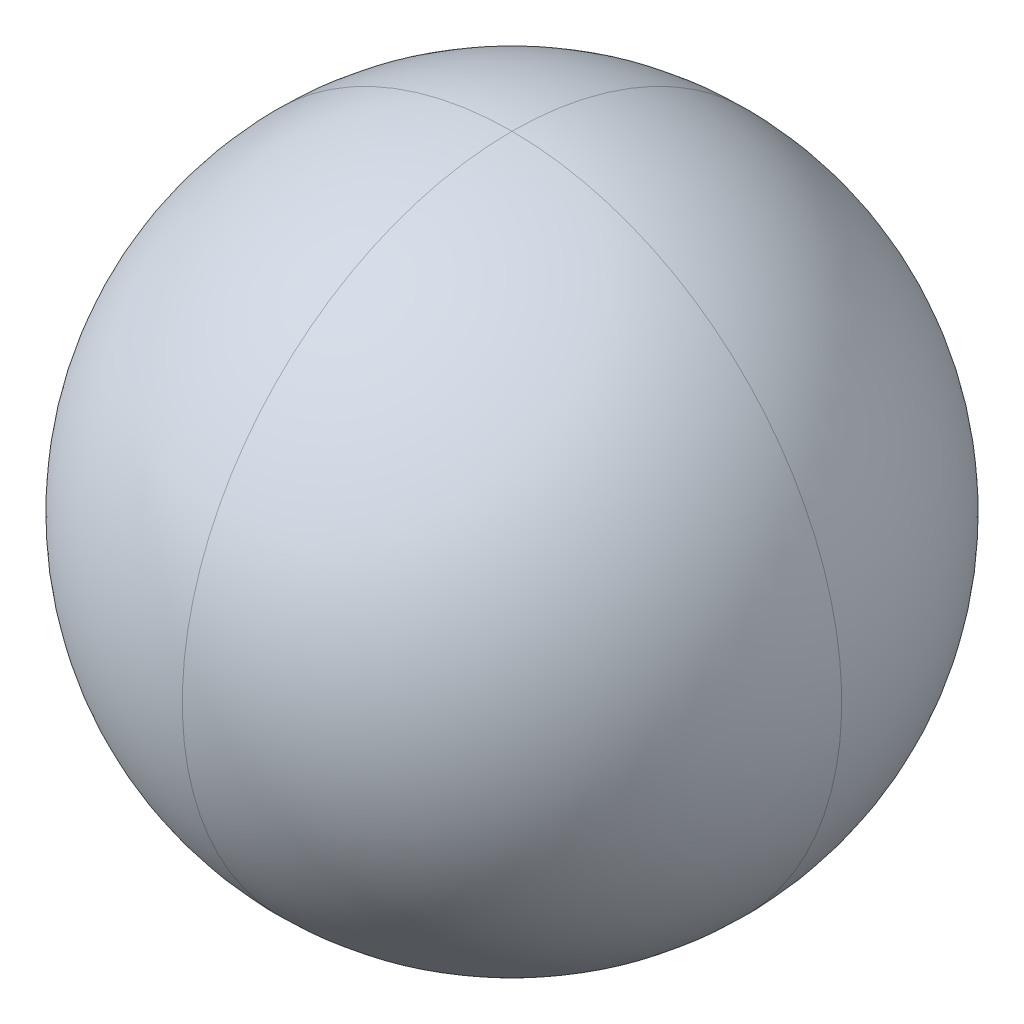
ISO-10303-21;
HEADER;
FILE_DESCRIPTION(('STEP AP214'),'2;1');
FILE_NAME('part.step','',(''),(''),'','','');
FILE_SCHEMA(('AUTOMOTIVE_DESIGN { 1 0 10303 214 1 1 1 1 }'));
ENDSEC;
DATA;
#1=APPLICATION_CONTEXT('core data for automotive mechanical design processes');
#2=APPLICATION_PROTOCOL_DEFINITION('international standard','automotive_design',2000,#1);
#3=PRODUCT_CONTEXT('',#1,'mechanical');
#4=PRODUCT('Part','Part','',(#3));
#5=PRODUCT_RELATED_PRODUCT_CATEGORY('part','',(#4));
#6=PRODUCT_DEFINITION_FORMATION('','',#4);
#7=PRODUCT_DEFINITION_CONTEXT('part definition',#1,'design');
#8=PRODUCT_DEFINITION('design','',#6,#7);
#9=PRODUCT_DEFINITION_SHAPE('','',#8);
#10=(LENGTH_UNIT() NAMED_UNIT(*) SI_UNIT(.MILLI.,.METRE.));
#11=(NAMED_UNIT(*) PLANE_ANGLE_UNIT() SI_UNIT($,.RADIAN.));
#12=(NAMED_UNIT(*) SI_UNIT($,.STERADIAN.) SOLID_ANGLE_UNIT());
#13=UNCERTAINTY_MEASURE_WITH_UNIT(LENGTH_MEASURE(1.E-05),#10,'distance_accuracy_value','');
#14=(GEOMETRIC_REPRESENTATION_CONTEXT(3) GLOBAL_UNCERTAINTY_ASSIGNED_CONTEXT((#13)) GLOBAL_UNIT_ASSIGNED_CONTEXT((#10,
#11,#12)) REPRESENTATION_CONTEXT('',''));
#15=CARTESIAN_POINT('',(0.,0.,0.));
#16=DIRECTION('',(0.,0.,1.));
#17=DIRECTION('',(1.,0.,0.));
#18=AXIS2_PLACEMENT_3D('',#15,#16,#17);
#19=CARTESIAN_POINT('',(0.,0.,0.));
#20=DIRECTION('',(0.,1.,0.));
#21=DIRECTION('',(1.,0.,0.));
#22=AXIS2_PLACEMENT_3D('',#19,#20,#21);
#23=SPHERICAL_SURFACE('',#22,25.4);
#24=CARTESIAN_POINT('',(0.,0.,0.));
#25=DIRECTION('',(0.,0.,-1.));
#26=DIRECTION('',(-1.,0.,0.));
#27=AXIS2_PLACEMENT_3D('',#24,#25,#26);
#28=CIRCLE('',#27,25.4);
#29=CARTESIAN_POINT('',(0.,-25.4,0.));
#30=VERTEX_POINT('',#29);
#31=CARTESIAN_POINT('',(0.,25.4,0.));
#32=VERTEX_POINT('',#31);
#33=EDGE_CURVE('E48',#30,#32,#28,.T.);
#34=ORIENTED_EDGE('',*,*,#33,.F.);
#35=CARTESIAN_POINT('',(0.,0.,0.));
#36=DIRECTION('',(-1.,0.,0.));
#37=DIRECTION('',(0.,0.,1.));
#38=AXIS2_PLACEMENT_3D('',#35,#36,#37);
#39=CIRCLE('',#38,25.4);
#40=EDGE_CURVE('E11',#30,#32,#39,.T.);
#41=ORIENTED_EDGE('',*,*,#40,.T.);
#42=EDGE_LOOP('',(#34,#41));
#43=FACE_BOUND('',#42,.T.);
#44=ADVANCED_FACE('F30',(#43),#23,.T.);
#45=ORIENTED_EDGE('',*,*,#33,.T.);
#46=CARTESIAN_POINT('',(0.,0.,0.));
#47=DIRECTION('',(-1.,0.,0.));
#48=DIRECTION('',(0.,0.,1.));
#49=AXIS2_PLACEMENT_3D('',#46,#47,#48);
#50=CIRCLE('',#49,25.4);
#51=EDGE_CURVE('E38',#32,#30,#50,.T.);
#52=ORIENTED_EDGE('',*,*,#51,.T.);
#53=EDGE_LOOP('',(#45,#52));
#54=FACE_BOUND('',#53,.T.);
#55=ADVANCED_FACE('F55',(#54),#23,.T.);
#56=ORIENTED_EDGE('',*,*,#51,.F.);
#57=EDGE_CURVE('E52',#32,#30,#28,.T.);
#58=ORIENTED_EDGE('',*,*,#57,.T.);
#59=EDGE_LOOP('',(#56,#58));
#60=FACE_BOUND('',#59,.T.);
#61=ADVANCED_FACE('F51',(#60),#23,.T.);
#62=ORIENTED_EDGE('',*,*,#40,.F.);
#63=ORIENTED_EDGE('',*,*,#57,.F.);
#64=EDGE_LOOP('',(#62,#63));
#65=FACE_BOUND('',#64,.T.);
#66=ADVANCED_FACE('F32',(#65),#23,.T.);
#67=CLOSED_SHELL('',(#44,#55,#61,#66));
#68=MANIFOLD_SOLID_BREP('B2',#67);
#69=ADVANCED_BREP_SHAPE_REPRESENTATION('',(#18,#68),#14);
#70=SHAPE_DEFINITION_REPRESENTATION(#9,#69);
ENDSEC;
END-ISO-10303-21;
